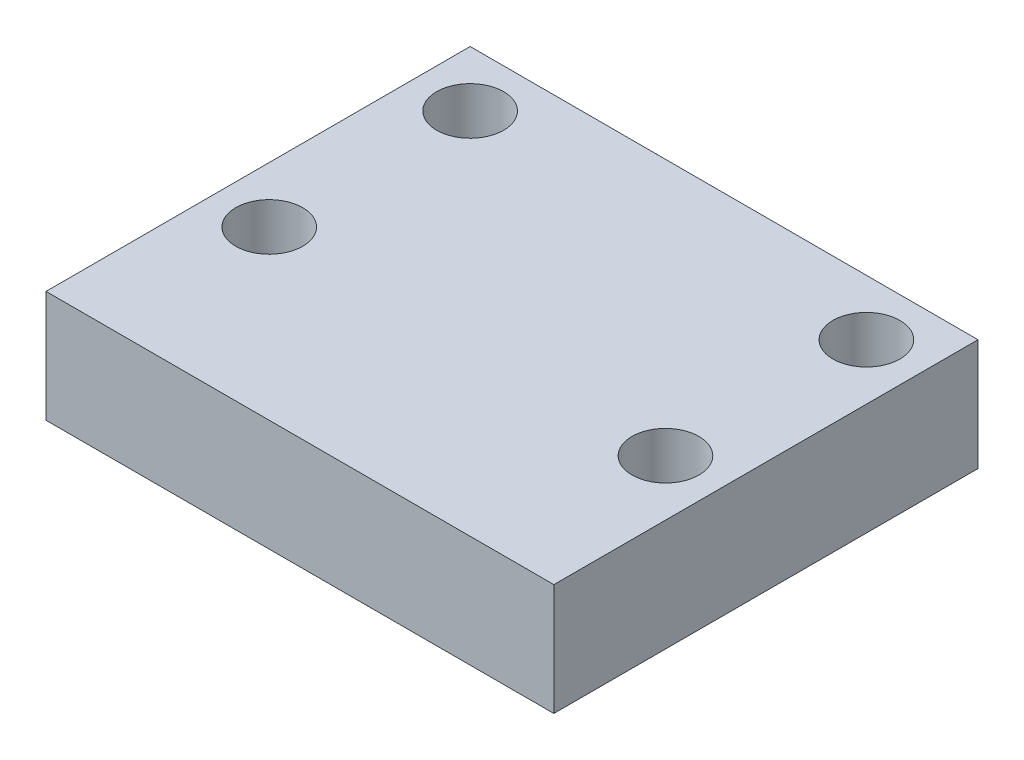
ISO-10303-21;
HEADER;
FILE_DESCRIPTION(('STEP AP214'),'2;1');
FILE_NAME('part.step','',(''),(''),'','','');
FILE_SCHEMA(('AUTOMOTIVE_DESIGN { 1 0 10303 214 1 1 1 1 }'));
ENDSEC;
DATA;
#1=APPLICATION_CONTEXT('core data for automotive mechanical design processes');
#2=APPLICATION_PROTOCOL_DEFINITION('international standard','automotive_design',2000,#1);
#3=PRODUCT_CONTEXT('',#1,'mechanical');
#4=PRODUCT('Part','Part','',(#3));
#5=PRODUCT_RELATED_PRODUCT_CATEGORY('part','',(#4));
#6=PRODUCT_DEFINITION_FORMATION('','',#4);
#7=PRODUCT_DEFINITION_CONTEXT('part definition',#1,'design');
#8=PRODUCT_DEFINITION('design','',#6,#7);
#9=PRODUCT_DEFINITION_SHAPE('','',#8);
#10=(LENGTH_UNIT() NAMED_UNIT(*) SI_UNIT(.MILLI.,.METRE.));
#11=(NAMED_UNIT(*) PLANE_ANGLE_UNIT() SI_UNIT($,.RADIAN.));
#12=(NAMED_UNIT(*) SI_UNIT($,.STERADIAN.) SOLID_ANGLE_UNIT());
#13=UNCERTAINTY_MEASURE_WITH_UNIT(LENGTH_MEASURE(1.E-05),#10,'distance_accuracy_value','');
#14=(GEOMETRIC_REPRESENTATION_CONTEXT(3) GLOBAL_UNCERTAINTY_ASSIGNED_CONTEXT((#13)) GLOBAL_UNIT_ASSIGNED_CONTEXT((#10,
#11,#12)) REPRESENTATION_CONTEXT('',''));
#15=CARTESIAN_POINT('',(0.,0.,0.));
#16=DIRECTION('',(0.,0.,1.));
#17=DIRECTION('',(1.,0.,0.));
#18=AXIS2_PLACEMENT_3D('',#15,#16,#17);
#19=CARTESIAN_POINT('',(0.,10.,0.));
#20=DIRECTION('',(0.,-1.,0.));
#21=DIRECTION('',(0.,0.,-1.));
#22=AXIS2_PLACEMENT_3D('',#19,#20,#21);
#23=PLANE('',#22);
#24=CARTESIAN_POINT('',(17.75,10.,4.));
#25=DIRECTION('',(0.,-1.,0.));
#26=DIRECTION('',(0.,0.,1.));
#27=AXIS2_PLACEMENT_3D('',#24,#25,#26);
#28=CIRCLE('',#27,3.);
#29=CARTESIAN_POINT('',(17.75,10.,7.00000000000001));
#30=VERTEX_POINT('',#29);
#31=EDGE_CURVE('E244',#30,#30,#28,.T.);
#32=ORIENTED_EDGE('',*,*,#31,.T.);
#33=EDGE_LOOP('',(#32));
#34=FACE_BOUND('',#33,.T.);
#35=CARTESIAN_POINT('',(17.75,10.,-14.));
#36=DIRECTION('',(0.,-1.,0.));
#37=DIRECTION('',(0.,0.,1.));
#38=AXIS2_PLACEMENT_3D('',#35,#36,#37);
#39=CIRCLE('',#38,3.);
#40=CARTESIAN_POINT('',(17.75,10.,-11.));
#41=VERTEX_POINT('',#40);
#42=EDGE_CURVE('E251',#41,#41,#39,.T.);
#43=ORIENTED_EDGE('',*,*,#42,.T.);
#44=EDGE_LOOP('',(#43));
#45=FACE_BOUND('',#44,.T.);
#46=CARTESIAN_POINT('',(-17.75,10.,-14.));
#47=DIRECTION('',(0.,-1.,0.));
#48=DIRECTION('',(0.,0.,-1.));
#49=AXIS2_PLACEMENT_3D('',#46,#47,#48);
#50=CIRCLE('',#49,3.);
#51=CARTESIAN_POINT('',(-17.75,10.,-17.));
#52=VERTEX_POINT('',#51);
#53=EDGE_CURVE('E241',#52,#52,#50,.T.);
#54=ORIENTED_EDGE('',*,*,#53,.T.);
#55=EDGE_LOOP('',(#54));
#56=FACE_BOUND('',#55,.T.);
#57=CARTESIAN_POINT('',(-17.75,10.,4.));
#58=DIRECTION('',(0.,-1.,0.));
#59=DIRECTION('',(0.,0.,-1.));
#60=AXIS2_PLACEMENT_3D('',#57,#58,#59);
#61=CIRCLE('',#60,3.);
#62=CARTESIAN_POINT('',(-17.75,10.,1.));
#63=VERTEX_POINT('',#62);
#64=EDGE_CURVE('E184',#63,#63,#61,.T.);
#65=ORIENTED_EDGE('',*,*,#64,.T.);
#66=EDGE_LOOP('',(#65));
#67=FACE_BOUND('',#66,.T.);
#68=DIRECTION('',(1.,0.,0.));
#69=VECTOR('',#68,1.);
#70=CARTESIAN_POINT('',(-22.75,10.,-19.));
#71=LINE('',#70,#69);
#72=CARTESIAN_POINT('',(-22.75,10.,-19.));
#73=VERTEX_POINT('',#72);
#74=CARTESIAN_POINT('',(22.75,10.,-19.));
#75=VERTEX_POINT('',#74);
#76=EDGE_CURVE('E171',#73,#75,#71,.T.);
#77=ORIENTED_EDGE('',*,*,#76,.F.);
#78=DIRECTION('',(0.,0.,1.));
#79=VECTOR('',#78,1.);
#80=CARTESIAN_POINT('',(-22.75,10.,-19.));
#81=LINE('',#80,#79);
#82=CARTESIAN_POINT('',(-22.75,10.,19.));
#83=VERTEX_POINT('',#82);
#84=EDGE_CURVE('E158',#73,#83,#81,.T.);
#85=ORIENTED_EDGE('',*,*,#84,.T.);
#86=DIRECTION('',(1.,0.,0.));
#87=VECTOR('',#86,1.);
#88=CARTESIAN_POINT('',(-22.75,10.,19.));
#89=LINE('',#88,#87);
#90=CARTESIAN_POINT('',(22.75,10.,19.));
#91=VERTEX_POINT('',#90);
#92=EDGE_CURVE('E154',#83,#91,#89,.T.);
#93=ORIENTED_EDGE('',*,*,#92,.T.);
#94=DIRECTION('',(0.,0.,1.));
#95=VECTOR('',#94,1.);
#96=CARTESIAN_POINT('',(22.75,10.,-19.));
#97=LINE('',#96,#95);
#98=EDGE_CURVE('E157',#75,#91,#97,.T.);
#99=ORIENTED_EDGE('',*,*,#98,.F.);
#100=EDGE_LOOP('',(#77,#85,#93,#99));
#101=FACE_BOUND('',#100,.T.);
#102=ADVANCED_FACE('F107',(#34,#45,#56,#67,#101),#23,.F.);
#103=CARTESIAN_POINT('',(0.,0.,0.));
#104=DIRECTION('',(0.,-1.,0.));
#105=DIRECTION('',(0.,0.,-1.));
#106=AXIS2_PLACEMENT_3D('',#103,#104,#105);
#107=PLANE('',#106);
#108=CARTESIAN_POINT('',(17.75,0.,4.));
#109=DIRECTION('',(0.,-1.,0.));
#110=DIRECTION('',(0.,0.,1.));
#111=AXIS2_PLACEMENT_3D('',#108,#109,#110);
#112=CIRCLE('',#111,3.);
#113=CARTESIAN_POINT('',(17.75,0.,7.00000000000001));
#114=VERTEX_POINT('',#113);
#115=EDGE_CURVE('E247',#114,#114,#112,.T.);
#116=ORIENTED_EDGE('',*,*,#115,.F.);
#117=EDGE_LOOP('',(#116));
#118=FACE_BOUND('',#117,.T.);
#119=CARTESIAN_POINT('',(17.75,0.,-14.));
#120=DIRECTION('',(0.,-1.,0.));
#121=DIRECTION('',(0.,0.,1.));
#122=AXIS2_PLACEMENT_3D('',#119,#120,#121);
#123=CIRCLE('',#122,3.);
#124=CARTESIAN_POINT('',(17.75,0.,-11.));
#125=VERTEX_POINT('',#124);
#126=EDGE_CURVE('E255',#125,#125,#123,.T.);
#127=ORIENTED_EDGE('',*,*,#126,.F.);
#128=EDGE_LOOP('',(#127));
#129=FACE_BOUND('',#128,.T.);
#130=CARTESIAN_POINT('',(-17.75,0.,-14.));
#131=DIRECTION('',(0.,-1.,0.));
#132=DIRECTION('',(0.,0.,-1.));
#133=AXIS2_PLACEMENT_3D('',#130,#131,#132);
#134=CIRCLE('',#133,3.);
#135=CARTESIAN_POINT('',(-17.75,0.,-17.));
#136=VERTEX_POINT('',#135);
#137=EDGE_CURVE('E236',#136,#136,#134,.T.);
#138=ORIENTED_EDGE('',*,*,#137,.F.);
#139=EDGE_LOOP('',(#138));
#140=FACE_BOUND('',#139,.T.);
#141=CARTESIAN_POINT('',(-17.75,0.,4.));
#142=DIRECTION('',(0.,-1.,0.));
#143=DIRECTION('',(0.,0.,-1.));
#144=AXIS2_PLACEMENT_3D('',#141,#142,#143);
#145=CIRCLE('',#144,3.);
#146=CARTESIAN_POINT('',(-17.75,0.,1.));
#147=VERTEX_POINT('',#146);
#148=EDGE_CURVE('E233',#147,#147,#145,.T.);
#149=ORIENTED_EDGE('',*,*,#148,.F.);
#150=EDGE_LOOP('',(#149));
#151=FACE_BOUND('',#150,.T.);
#152=DIRECTION('',(1.,0.,0.));
#153=VECTOR('',#152,1.);
#154=CARTESIAN_POINT('',(-22.75,0.,-19.));
#155=LINE('',#154,#153);
#156=CARTESIAN_POINT('',(-22.75,0.,-19.));
#157=VERTEX_POINT('',#156);
#158=CARTESIAN_POINT('',(22.75,0.,-19.));
#159=VERTEX_POINT('',#158);
#160=EDGE_CURVE('E179',#157,#159,#155,.T.);
#161=ORIENTED_EDGE('',*,*,#160,.T.);
#162=DIRECTION('',(0.,0.,1.));
#163=VECTOR('',#162,1.);
#164=CARTESIAN_POINT('',(22.75,0.,-19.));
#165=LINE('',#164,#163);
#166=CARTESIAN_POINT('',(22.75,0.,19.));
#167=VERTEX_POINT('',#166);
#168=EDGE_CURVE('E183',#159,#167,#165,.T.);
#169=ORIENTED_EDGE('',*,*,#168,.T.);
#170=DIRECTION('',(1.,0.,0.));
#171=VECTOR('',#170,1.);
#172=CARTESIAN_POINT('',(-22.75,0.,19.));
#173=LINE('',#172,#171);
#174=CARTESIAN_POINT('',(-22.75,0.,19.));
#175=VERTEX_POINT('',#174);
#176=EDGE_CURVE('E166',#175,#167,#173,.T.);
#177=ORIENTED_EDGE('',*,*,#176,.F.);
#178=DIRECTION('',(0.,0.,1.));
#179=VECTOR('',#178,1.);
#180=CARTESIAN_POINT('',(-22.75,0.,-19.));
#181=LINE('',#180,#179);
#182=EDGE_CURVE('E142',#157,#175,#181,.T.);
#183=ORIENTED_EDGE('',*,*,#182,.F.);
#184=EDGE_LOOP('',(#161,#169,#177,#183));
#185=FACE_BOUND('',#184,.T.);
#186=ADVANCED_FACE('F193',(#118,#129,#140,#151,#185),#107,.T.);
#187=CARTESIAN_POINT('',(-22.75,10.,-19.));
#188=DIRECTION('',(0.,0.,-1.));
#189=DIRECTION('',(-1.,0.,0.));
#190=AXIS2_PLACEMENT_3D('',#187,#188,#189);
#191=PLANE('',#190);
#192=ORIENTED_EDGE('',*,*,#160,.F.);
#193=DIRECTION('',(0.,-1.,0.));
#194=VECTOR('',#193,1.);
#195=CARTESIAN_POINT('',(-22.75,10.,-19.));
#196=LINE('',#195,#194);
#197=EDGE_CURVE('E12',#73,#157,#196,.T.);
#198=ORIENTED_EDGE('',*,*,#197,.F.);
#199=ORIENTED_EDGE('',*,*,#76,.T.);
#200=DIRECTION('',(0.,-1.,0.));
#201=VECTOR('',#200,1.);
#202=CARTESIAN_POINT('',(22.75,10.,-19.));
#203=LINE('',#202,#201);
#204=EDGE_CURVE('E111',#75,#159,#203,.T.);
#205=ORIENTED_EDGE('',*,*,#204,.T.);
#206=EDGE_LOOP('',(#192,#198,#199,#205));
#207=FACE_BOUND('',#206,.T.);
#208=ADVANCED_FACE('F109',(#207),#191,.T.);
#209=CARTESIAN_POINT('',(-22.75,10.,-19.));
#210=DIRECTION('',(1.,0.,0.));
#211=DIRECTION('',(0.,0.,-1.));
#212=AXIS2_PLACEMENT_3D('',#209,#210,#211);
#213=PLANE('',#212);
#214=ORIENTED_EDGE('',*,*,#182,.T.);
#215=DIRECTION('',(0.,-1.,0.));
#216=VECTOR('',#215,1.);
#217=CARTESIAN_POINT('',(-22.75,10.,19.));
#218=LINE('',#217,#216);
#219=EDGE_CURVE('E118',#83,#175,#218,.T.);
#220=ORIENTED_EDGE('',*,*,#219,.F.);
#221=ORIENTED_EDGE('',*,*,#84,.F.);
#222=ORIENTED_EDGE('',*,*,#197,.T.);
#223=EDGE_LOOP('',(#214,#220,#221,#222));
#224=FACE_BOUND('',#223,.T.);
#225=ADVANCED_FACE('F196',(#224),#213,.F.);
#226=CARTESIAN_POINT('',(-22.75,10.,19.));
#227=DIRECTION('',(0.,0.,-1.));
#228=DIRECTION('',(-1.,0.,0.));
#229=AXIS2_PLACEMENT_3D('',#226,#227,#228);
#230=PLANE('',#229);
#231=ORIENTED_EDGE('',*,*,#176,.T.);
#232=DIRECTION('',(0.,-1.,0.));
#233=VECTOR('',#232,1.);
#234=CARTESIAN_POINT('',(22.75,10.,19.));
#235=LINE('',#234,#233);
#236=EDGE_CURVE('E163',#91,#167,#235,.T.);
#237=ORIENTED_EDGE('',*,*,#236,.F.);
#238=ORIENTED_EDGE('',*,*,#92,.F.);
#239=ORIENTED_EDGE('',*,*,#219,.T.);
#240=EDGE_LOOP('',(#231,#237,#238,#239));
#241=FACE_BOUND('',#240,.T.);
#242=ADVANCED_FACE('F164',(#241),#230,.F.);
#243=CARTESIAN_POINT('',(22.75,10.,-19.));
#244=DIRECTION('',(1.,0.,0.));
#245=DIRECTION('',(0.,0.,-1.));
#246=AXIS2_PLACEMENT_3D('',#243,#244,#245);
#247=PLANE('',#246);
#248=ORIENTED_EDGE('',*,*,#168,.F.);
#249=ORIENTED_EDGE('',*,*,#204,.F.);
#250=ORIENTED_EDGE('',*,*,#98,.T.);
#251=ORIENTED_EDGE('',*,*,#236,.T.);
#252=EDGE_LOOP('',(#248,#249,#250,#251));
#253=FACE_BOUND('',#252,.T.);
#254=ADVANCED_FACE('F169',(#253),#247,.T.);
#255=CARTESIAN_POINT('',(-17.75,10.,4.));
#256=DIRECTION('',(0.,-1.,0.));
#257=DIRECTION('',(0.,0.,-1.));
#258=AXIS2_PLACEMENT_3D('',#255,#256,#257);
#259=CYLINDRICAL_SURFACE('',#258,3.);
#260=ORIENTED_EDGE('',*,*,#64,.F.);
#261=EDGE_LOOP('',(#260));
#262=FACE_BOUND('',#261,.T.);
#263=ORIENTED_EDGE('',*,*,#148,.T.);
#264=EDGE_LOOP('',(#263));
#265=FACE_BOUND('',#264,.T.);
#266=ADVANCED_FACE('F213',(#262,#265),#259,.F.);
#267=CARTESIAN_POINT('',(-17.75,10.,-14.));
#268=DIRECTION('',(0.,-1.,0.));
#269=DIRECTION('',(0.,0.,-1.));
#270=AXIS2_PLACEMENT_3D('',#267,#268,#269);
#271=CYLINDRICAL_SURFACE('',#270,3.);
#272=ORIENTED_EDGE('',*,*,#53,.F.);
#273=EDGE_LOOP('',(#272));
#274=FACE_BOUND('',#273,.T.);
#275=ORIENTED_EDGE('',*,*,#137,.T.);
#276=EDGE_LOOP('',(#275));
#277=FACE_BOUND('',#276,.T.);
#278=ADVANCED_FACE('F220',(#274,#277),#271,.F.);
#279=CARTESIAN_POINT('',(17.75,10.,-14.));
#280=DIRECTION('',(0.,-1.,0.));
#281=DIRECTION('',(0.,0.,-1.));
#282=AXIS2_PLACEMENT_3D('',#279,#280,#281);
#283=CYLINDRICAL_SURFACE('',#282,3.);
#284=ORIENTED_EDGE('',*,*,#42,.F.);
#285=EDGE_LOOP('',(#284));
#286=FACE_BOUND('',#285,.T.);
#287=ORIENTED_EDGE('',*,*,#126,.T.);
#288=EDGE_LOOP('',(#287));
#289=FACE_BOUND('',#288,.T.);
#290=ADVANCED_FACE('F225',(#286,#289),#283,.F.);
#291=CARTESIAN_POINT('',(17.75,10.,4.));
#292=DIRECTION('',(0.,-1.,0.));
#293=DIRECTION('',(0.,0.,-1.));
#294=AXIS2_PLACEMENT_3D('',#291,#292,#293);
#295=CYLINDRICAL_SURFACE('',#294,3.);
#296=ORIENTED_EDGE('',*,*,#31,.F.);
#297=EDGE_LOOP('',(#296));
#298=FACE_BOUND('',#297,.T.);
#299=ORIENTED_EDGE('',*,*,#115,.T.);
#300=EDGE_LOOP('',(#299));
#301=FACE_BOUND('',#300,.T.);
#302=ADVANCED_FACE('F271',(#298,#301),#295,.F.);
#303=CLOSED_SHELL('',(#102,#186,#208,#225,#242,#254,#266,#278,#290,#302));
#304=MANIFOLD_SOLID_BREP('B2',#303);
#305=ADVANCED_BREP_SHAPE_REPRESENTATION('',(#18,#304),#14);
#306=SHAPE_DEFINITION_REPRESENTATION(#9,#305);
ENDSEC;
END-ISO-10303-21;
